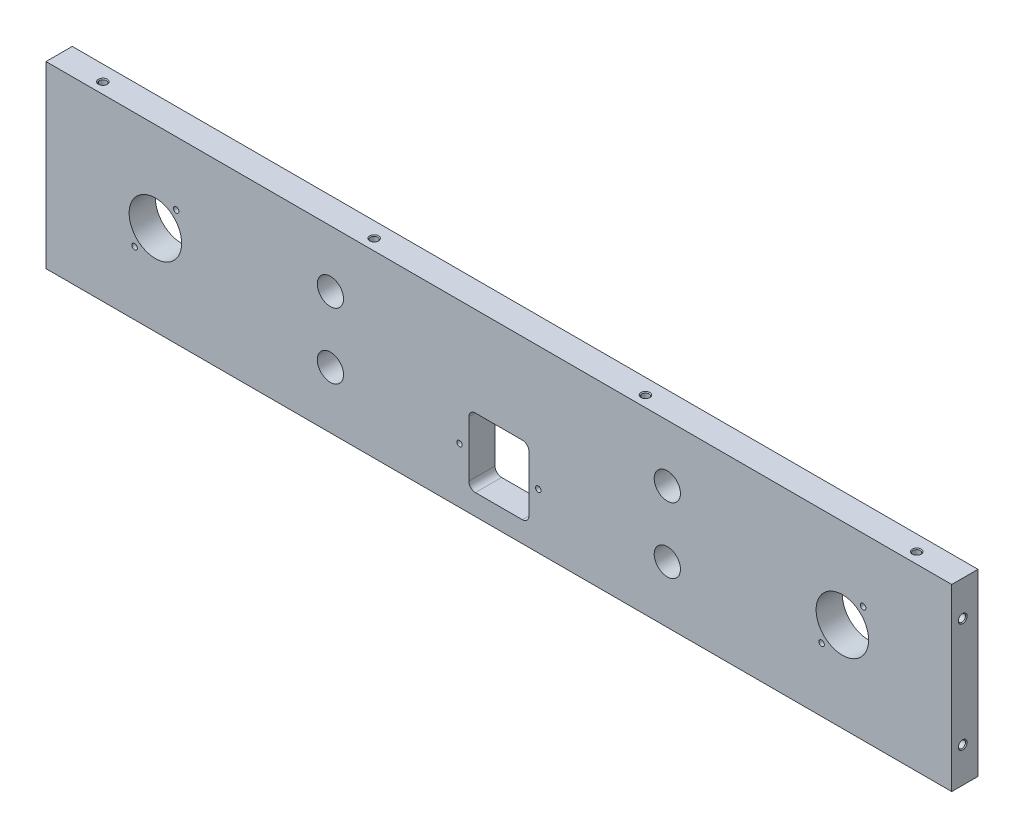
from build123d import *

# Parameters (mm, degrees)
SKETCH_1_W                   = 414
SKETCH_1_H                   = 82
EXTRUDE_1_DEPTH              = 12
SKETCH_2_R                   = 6
SKETCH_2_R_2                 = 12
SKETCH_2_W                   = 27.5
SKETCH_2_H                   = 31.5
CUT_EXTRUDE_5_DEPTH          = 423.213216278
FILLET_1_R                   = 3
HOLE_WIZARD_M3_1_D           = 2.5
HOLE_WIZARD_M3_1_CSINK_D     = 3.05
HOLE_WIZARD_M3_1_CSINK_ANGLE = 90
HOLE_WIZARD_M4_1_D           = 3.3
HOLE_WIZARD_M4_1_CSINK_D     = 4.05
HOLE_WIZARD_M4_1_CSINK_ANGLE = 90
HOLE_WIZARD_M4_3_D           = 3.3
HOLE_WIZARD_M4_3_DEPTH       = 7.1
HOLE_WIZARD_M4_3_CSINK_D     = 4.05
HOLE_WIZARD_M4_3_CSINK_ANGLE = 90
HOLE_WIZARD_M4_3_TIP         = 0.991420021
HOLE_WIZARD_M4_4_D           = 3.3
HOLE_WIZARD_M4_4_DEPTH       = 7.1
HOLE_WIZARD_M4_4_CSINK_D     = 4.05
HOLE_WIZARD_M4_4_CSINK_ANGLE = 90
HOLE_WIZARD_M4_4_TIP         = 0.991420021


with BuildPart() as part:
    # Sketch 1 → Extrude 1 (new body)
    with BuildSketch(Plane.XY):
        with Locations((207, 41)):
            Rectangle(SKETCH_1_W, SKETCH_1_H)
    extrude(amount=EXTRUDE_1_DEPTH)

    # Sketch 2 → Cut-Extrude 5 (cut, through all)
    with BuildSketch(Plane.XY):
        with Locations((130, 56)):
            Circle(SKETCH_2_R)
        with Locations((130, 26)):
            Circle(SKETCH_2_R)
        with Locations((284, 56)):
            Circle(SKETCH_2_R)
        with Locations((284, 26)):
            Circle(SKETCH_2_R)
        with Locations((50, 41)):
            Circle(SKETCH_2_R_2)
        with Locations((364, 41)):
            Circle(SKETCH_2_R_2)
        with Locations((207, 25.25)):
            Rectangle(SKETCH_2_W, SKETCH_2_H)
    extrude(amount=CUT_EXTRUDE_5_DEPTH, mode=Mode.SUBTRACT)

    # Fillet 1
    fillet_1_edges = [part.edges().sort_by_distance(p)[0] for p in [
        (220.75, 9.5, 6),
        (220.75, 41, 6),
        (193.25, 41, 6),
        (193.25, 9.5, 6),
    ]]
    fillet(fillet_1_edges, radius=FILLET_1_R)

    # Hole Wizard M3 _1 (through all)
    with Locations(Plane(origin=(0, 0, 0), x_dir=(1, 0, 0), z_dir=(0, 0, -1))):
        with Locations((59.5, -53), (40.5, -29), (189, -25.25), (225, -25.25), (373.5, -53), (354.5, -29)):
            CounterSinkHole(HOLE_WIZARD_M3_1_D / 2, HOLE_WIZARD_M3_1_CSINK_D / 2, counter_sink_angle=HOLE_WIZARD_M3_1_CSINK_ANGLE)

    # Hole Wizard M4 _1 (through all)
    with Locations(Plane(origin=(0, 82, 0), x_dir=(1, 0, 0), z_dir=(0, 1, 0))):
        with Locations((21, -7), (145, -7), (269, -7), (393, -7)):
            CounterSinkHole(HOLE_WIZARD_M4_1_D / 2, HOLE_WIZARD_M4_1_CSINK_D / 2, counter_sink_angle=HOLE_WIZARD_M4_1_CSINK_ANGLE)

    # Hole Wizard M4 _3
    with Locations(Plane(origin=(414, 0, 0), x_dir=(0, 0, -1), z_dir=(1, 0, 0))):
        with Locations((-7, 16), (-7, 66)):
            CounterSinkHole(HOLE_WIZARD_M4_3_D / 2, HOLE_WIZARD_M4_3_CSINK_D / 2, depth=HOLE_WIZARD_M4_3_DEPTH, counter_sink_angle=HOLE_WIZARD_M4_3_CSINK_ANGLE)
            with Locations((0, 0, -(HOLE_WIZARD_M4_3_DEPTH + HOLE_WIZARD_M4_3_TIP / 2))):  # 118° drill point
                Cone(0, HOLE_WIZARD_M4_3_D / 2, HOLE_WIZARD_M4_3_TIP, mode=Mode.SUBTRACT)

    # Hole Wizard M4 _4
    with Locations(Plane.ZY):
        with Locations((7, 16), (7, 66)):
            CounterSinkHole(HOLE_WIZARD_M4_4_D / 2, HOLE_WIZARD_M4_4_CSINK_D / 2, depth=HOLE_WIZARD_M4_4_DEPTH, counter_sink_angle=HOLE_WIZARD_M4_4_CSINK_ANGLE)
            with Locations((0, 0, -(HOLE_WIZARD_M4_4_DEPTH + HOLE_WIZARD_M4_4_TIP / 2))):  # 118° drill point
                Cone(0, HOLE_WIZARD_M4_4_D / 2, HOLE_WIZARD_M4_4_TIP, mode=Mode.SUBTRACT)


solid = part.part
